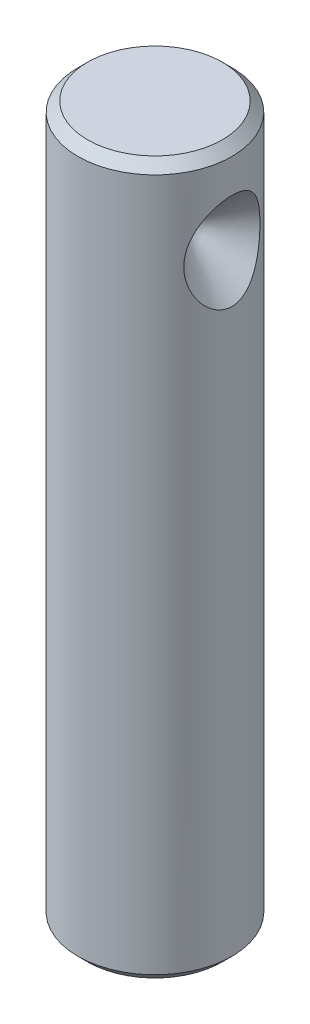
ISO-10303-21;
HEADER;
FILE_DESCRIPTION(('STEP AP214'),'2;1');
FILE_NAME('part.step','',(''),(''),'','','');
FILE_SCHEMA(('AUTOMOTIVE_DESIGN { 1 0 10303 214 1 1 1 1 }'));
ENDSEC;
DATA;
#1=APPLICATION_CONTEXT('core data for automotive mechanical design processes');
#2=APPLICATION_PROTOCOL_DEFINITION('international standard','automotive_design',2000,#1);
#3=PRODUCT_CONTEXT('',#1,'mechanical');
#4=PRODUCT('Part','Part','',(#3));
#5=PRODUCT_RELATED_PRODUCT_CATEGORY('part','',(#4));
#6=PRODUCT_DEFINITION_FORMATION('','',#4);
#7=PRODUCT_DEFINITION_CONTEXT('part definition',#1,'design');
#8=PRODUCT_DEFINITION('design','',#6,#7);
#9=PRODUCT_DEFINITION_SHAPE('','',#8);
#10=(LENGTH_UNIT() NAMED_UNIT(*) SI_UNIT(.MILLI.,.METRE.));
#11=(NAMED_UNIT(*) PLANE_ANGLE_UNIT() SI_UNIT($,.RADIAN.));
#12=(NAMED_UNIT(*) SI_UNIT($,.STERADIAN.) SOLID_ANGLE_UNIT());
#13=UNCERTAINTY_MEASURE_WITH_UNIT(LENGTH_MEASURE(1.E-05),#10,'distance_accuracy_value','');
#14=(GEOMETRIC_REPRESENTATION_CONTEXT(3) GLOBAL_UNCERTAINTY_ASSIGNED_CONTEXT((#13)) GLOBAL_UNIT_ASSIGNED_CONTEXT((#10,
#11,#12)) REPRESENTATION_CONTEXT('',''));
#15=CARTESIAN_POINT('',(0.,0.,0.));
#16=DIRECTION('',(0.,0.,1.));
#17=DIRECTION('',(1.,0.,0.));
#18=AXIS2_PLACEMENT_3D('',#15,#16,#17);
#19=CARTESIAN_POINT('',(0.,37.,0.));
#20=DIRECTION('',(0.,-1.,0.));
#21=DIRECTION('',(0.,0.,-1.));
#22=AXIS2_PLACEMENT_3D('',#19,#20,#21);
#23=CYLINDRICAL_SURFACE('',#22,4.);
#24=CARTESIAN_POINT('',(3.88248247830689,30.0705801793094,-0.962466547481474));
#25=CARTESIAN_POINT('',(3.90125564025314,30.0166133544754,-0.886733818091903));
#26=CARTESIAN_POINT('',(3.91870439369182,29.9679689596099,-0.806848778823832));
#27=CARTESIAN_POINT('',(3.94943555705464,29.8837611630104,-0.639655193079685));
#28=CARTESIAN_POINT('',(3.96272024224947,29.8481906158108,-0.55235073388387));
#29=CARTESIAN_POINT('',(3.98376478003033,29.7923507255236,-0.371432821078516));
#30=CARTESIAN_POINT('',(3.991477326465,29.7722123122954,-0.277772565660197));
#31=CARTESIAN_POINT('',(4.00015429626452,29.7495789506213,-0.088047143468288));
#32=CARTESIAN_POINT('',(4.00112416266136,29.74706977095,0.00801602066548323));
#33=CARTESIAN_POINT('',(3.99653893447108,29.7590083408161,0.185743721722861));
#34=CARTESIAN_POINT('',(3.99185086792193,29.7712026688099,0.267594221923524));
#35=CARTESIAN_POINT('',(3.97784990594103,29.8080193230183,0.428013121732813));
#36=CARTESIAN_POINT('',(3.96853631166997,29.832643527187,0.506581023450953));
#37=CARTESIAN_POINT('',(3.94586197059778,29.8935727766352,0.66059667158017));
#38=CARTESIAN_POINT('',(3.93240926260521,29.9301445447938,0.735923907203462));
#39=CARTESIAN_POINT('',(3.90261115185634,30.0129960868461,0.880385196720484));
#40=CARTESIAN_POINT('',(3.88626383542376,30.0592822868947,0.949515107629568));
#41=CARTESIAN_POINT('',(3.84298305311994,30.1854240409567,1.11444521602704));
#42=CARTESIAN_POINT('',(3.81488034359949,30.270410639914,1.20602742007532));
#43=CARTESIAN_POINT('',(3.75774709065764,30.4541942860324,1.37376207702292));
#44=CARTESIAN_POINT('',(3.72871490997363,30.5530168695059,1.44988534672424));
#45=CARTESIAN_POINT('',(3.67200298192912,30.7631260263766,1.58810352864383));
#46=CARTESIAN_POINT('',(3.64435853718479,30.8746106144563,1.64991046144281));
#47=CARTESIAN_POINT('',(3.59359054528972,31.1058419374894,1.75774167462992));
#48=CARTESIAN_POINT('',(3.57046590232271,31.2255866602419,1.80376978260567));
#49=CARTESIAN_POINT('',(3.52731052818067,31.493778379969,1.88698124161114));
#50=CARTESIAN_POINT('',(3.50863355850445,31.6434504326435,1.92097533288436));
#51=CARTESIAN_POINT('',(3.48349335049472,31.9472003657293,1.96620375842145));
#52=CARTESIAN_POINT('',(3.47702986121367,32.1012781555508,1.97743856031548));
#53=CARTESIAN_POINT('',(3.47733098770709,32.4089559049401,1.97690907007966));
#54=CARTESIAN_POINT('',(3.48405885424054,32.562556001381,1.96520867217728));
#55=CARTESIAN_POINT('',(3.50962061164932,32.8653600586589,1.91917641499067));
#56=CARTESIAN_POINT('',(3.5284620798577,33.0145612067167,1.88483039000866));
#57=CARTESIAN_POINT('',(3.57549079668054,33.3043878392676,1.79400822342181));
#58=CARTESIAN_POINT('',(3.60367294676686,33.4450179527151,1.7375441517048));
#59=CARTESIAN_POINT('',(3.66566251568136,33.7140163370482,1.6026297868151));
#60=CARTESIAN_POINT('',(3.69946752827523,33.8423898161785,1.52418888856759));
#61=CARTESIAN_POINT('',(3.7607376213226,34.055941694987,1.36471837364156));
#62=CARTESIAN_POINT('',(3.78797017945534,34.144423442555,1.28801624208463));
#63=CARTESIAN_POINT('',(3.84071645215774,34.3079935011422,1.12095456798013));
#64=CARTESIAN_POINT('',(3.86623304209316,34.3831045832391,1.03061873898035));
#65=CARTESIAN_POINT('',(3.9076436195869,34.5013239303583,0.858116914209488));
#66=CARTESIAN_POINT('',(3.92442053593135,34.5478380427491,0.778506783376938));
#67=CARTESIAN_POINT('',(3.95376519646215,34.6278978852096,0.612244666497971));
#68=CARTESIAN_POINT('',(3.96633589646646,34.6614527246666,0.525597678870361));
#69=CARTESIAN_POINT('',(3.98599227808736,34.7134911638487,0.346455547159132));
#70=CARTESIAN_POINT('',(3.99303376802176,34.7318533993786,0.253919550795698));
#71=CARTESIAN_POINT('',(4.00053514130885,34.7514060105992,0.0667923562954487));
#72=CARTESIAN_POINT('',(4.00099929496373,34.7526075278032,-0.0277974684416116));
#73=CARTESIAN_POINT('',(3.99566178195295,34.7387063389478,-0.203592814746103));
#74=CARTESIAN_POINT('',(3.99063668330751,34.7256244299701,-0.284992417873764));
#75=CARTESIAN_POINT('',(3.97604362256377,34.6872065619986,-0.444394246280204));
#76=CARTESIAN_POINT('',(3.96647493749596,34.6618686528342,-0.522395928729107));
#77=CARTESIAN_POINT('',(3.94328553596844,34.5994398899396,-0.675809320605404));
#78=CARTESIAN_POINT('',(3.92954529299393,34.5619998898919,-0.751059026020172));
#79=CARTESIAN_POINT('',(3.8992233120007,34.4774520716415,-0.895264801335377));
#80=CARTESIAN_POINT('',(3.88263963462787,34.4303376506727,-0.964216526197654));
#81=CARTESIAN_POINT('',(3.83875449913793,34.3019203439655,-1.12893437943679));
#82=CARTESIAN_POINT('',(3.81030855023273,34.2154540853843,-1.22038427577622));
#83=CARTESIAN_POINT('',(3.75264568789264,34.0287184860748,-1.38762709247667));
#84=CARTESIAN_POINT('',(3.72342743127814,33.9284236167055,-1.46339039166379));
#85=CARTESIAN_POINT('',(3.66654328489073,33.7153818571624,-1.60064852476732));
#86=CARTESIAN_POINT('',(3.63891594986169,33.6024394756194,-1.66185452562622));
#87=CARTESIAN_POINT('',(3.58841979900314,33.3683396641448,-1.76825013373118));
#88=CARTESIAN_POINT('',(3.56554972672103,33.2471844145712,-1.81344397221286));
#89=CARTESIAN_POINT('',(3.52335011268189,32.9767765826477,-1.89432699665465));
#90=CARTESIAN_POINT('',(3.50537521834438,32.8263611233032,-1.92689283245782));
#91=CARTESIAN_POINT('',(3.48182356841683,32.5214012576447,-1.96913759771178));
#92=CARTESIAN_POINT('',(3.47624613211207,32.3668570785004,-1.97881778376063));
#93=CARTESIAN_POINT('',(3.4783613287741,32.0590758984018,-1.97509611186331));
#94=CARTESIAN_POINT('',(3.48597384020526,31.9058366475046,-1.96183361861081));
#95=CARTESIAN_POINT('',(3.5131357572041,31.6040053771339,-1.91275859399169));
#96=CARTESIAN_POINT('',(3.53269465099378,31.4554171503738,-1.87692813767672));
#97=CARTESIAN_POINT('',(3.58097250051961,31.1666802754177,-1.78309093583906));
#98=CARTESIAN_POINT('',(3.60971010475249,31.0265495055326,-1.72503899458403));
#99=CARTESIAN_POINT('',(3.6725298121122,30.7589345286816,-1.58690632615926));
#100=CARTESIAN_POINT('',(3.70660622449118,30.6314370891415,-1.50684898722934));
#101=CARTESIAN_POINT('',(3.76547618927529,30.4287181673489,-1.35126497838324));
#102=CARTESIAN_POINT('',(3.79005817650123,30.3491380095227,-1.28130751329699));
#103=CARTESIAN_POINT('',(3.83783022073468,30.2009211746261,-1.13018966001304));
#104=CARTESIAN_POINT('',(3.86102172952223,30.1322729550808,-1.04904125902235));
#105=CARTESIAN_POINT('',(3.88248247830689,30.0705801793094,-0.962466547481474));
#106=B_SPLINE_CURVE_WITH_KNOTS('',3,(#24,#25,#26,#27,#28,#29,#30,#31,#32,#33,#34,#35,#36,#37,
#38,#39,#40,#41,#42,#43,#44,#45,#46,#47,#48,#49,#50,#51,#52,#53,#54,#55,#56,#57,#58,#59,#60,#61,
#62,#63,#64,#65,#66,#67,#68,#69,#70,#71,#72,#73,#74,#75,#76,#77,#78,#79,#80,#81,#82,#83,#84,#85,
#86,#87,#88,#89,#90,#91,#92,#93,#94,#95,#96,#97,#98,#99,#100,#101,#102,#103,#104,#105),
.UNSPECIFIED.,.T.,.F.,(4,2,2,2,2,2,2,2,2,2,2,2,2,2,2,2,2,2,2,2,2,2,2,2,2,2,2,2,2,2,2,2,2,2,2,2,
2,2,2,2,4),(0.,0.284327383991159,0.568499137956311,0.85505596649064,1.14138144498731,
1.38887768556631,1.63641133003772,1.88989913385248,2.14355515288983,2.52563967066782,
2.90843891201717,3.29837448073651,3.6882153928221,4.14983989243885,4.61145490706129,
5.0717857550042,5.5324048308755,5.99277289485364,6.45294445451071,6.81235772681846,
7.17115291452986,7.45122971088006,7.73110927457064,8.01320360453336,8.29511477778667,
8.54175987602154,8.78844423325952,9.04299810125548,9.2977262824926,9.68270016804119,
10.0683945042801,10.4612001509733,10.8539019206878,11.3164984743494,11.7790696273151,
12.2388407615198,12.6989775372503,13.160055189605,13.6206446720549,13.9460225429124,
14.2710545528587),.UNSPECIFIED.);
#107=CARTESIAN_POINT('',(3.88248247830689,30.0705801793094,-0.962466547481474));
#108=VERTEX_POINT('',#107);
#109=EDGE_CURVE('E46',#108,#108,#106,.T.);
#110=ORIENTED_EDGE('',*,*,#109,.T.);
#111=EDGE_LOOP('',(#110));
#112=FACE_BOUND('',#111,.T.);
#113=CARTESIAN_POINT('',(0.,0.5,0.));
#114=DIRECTION('',(0.,1.,0.));
#115=DIRECTION('',(0.,0.,1.));
#116=AXIS2_PLACEMENT_3D('',#113,#114,#115);
#117=CIRCLE('',#116,4.);
#118=CARTESIAN_POINT('',(0.,0.5,4.));
#119=VERTEX_POINT('',#118);
#120=EDGE_CURVE('E65',#119,#119,#117,.T.);
#121=ORIENTED_EDGE('',*,*,#120,.T.);
#122=EDGE_LOOP('',(#121));
#123=FACE_BOUND('',#122,.T.);
#124=CARTESIAN_POINT('',(0.,36.5,0.));
#125=DIRECTION('',(0.,1.,0.));
#126=DIRECTION('',(0.,0.,1.));
#127=AXIS2_PLACEMENT_3D('',#124,#125,#126);
#128=CIRCLE('',#127,4.);
#129=CARTESIAN_POINT('',(0.,36.5,4.));
#130=VERTEX_POINT('',#129);
#131=EDGE_CURVE('E63',#130,#130,#128,.F.);
#132=ORIENTED_EDGE('',*,*,#131,.T.);
#133=EDGE_LOOP('',(#132));
#134=FACE_BOUND('',#133,.T.);
#135=ADVANCED_FACE('F42',(#112,#123,#134),#23,.T.);
#136=CARTESIAN_POINT('',(0.,37.,0.));
#137=DIRECTION('',(0.,1.,0.));
#138=DIRECTION('',(0.,0.,1.));
#139=AXIS2_PLACEMENT_3D('',#136,#137,#138);
#140=PLANE('',#139);
#141=CARTESIAN_POINT('',(0.,37.,0.));
#142=DIRECTION('',(0.,1.,0.));
#143=DIRECTION('',(0.,0.,1.));
#144=AXIS2_PLACEMENT_3D('',#141,#142,#143);
#145=CIRCLE('',#144,3.5);
#146=CARTESIAN_POINT('',(0.,37.,3.5));
#147=VERTEX_POINT('',#146);
#148=EDGE_CURVE('E13',#147,#147,#145,.T.);
#149=ORIENTED_EDGE('',*,*,#148,.T.);
#150=EDGE_LOOP('',(#149));
#151=FACE_BOUND('',#150,.T.);
#152=ADVANCED_FACE('F83',(#151),#140,.T.);
#153=CARTESIAN_POINT('',(0.,0.,0.));
#154=DIRECTION('',(0.,1.,0.));
#155=DIRECTION('',(0.,0.,1.));
#156=AXIS2_PLACEMENT_3D('',#153,#154,#155);
#157=PLANE('',#156);
#158=CARTESIAN_POINT('',(0.,0.,0.));
#159=DIRECTION('',(0.,1.,0.));
#160=DIRECTION('',(0.,0.,1.));
#161=AXIS2_PLACEMENT_3D('',#158,#159,#160);
#162=CIRCLE('',#161,3.5);
#163=CARTESIAN_POINT('',(0.,0.,3.5));
#164=VERTEX_POINT('',#163);
#165=EDGE_CURVE('E54',#164,#164,#162,.F.);
#166=ORIENTED_EDGE('',*,*,#165,.T.);
#167=EDGE_LOOP('',(#166));
#168=FACE_BOUND('',#167,.T.);
#169=ADVANCED_FACE('F75',(#168),#157,.F.);
#170=CARTESIAN_POINT('',(0.,0.5,0.));
#171=DIRECTION('',(0.,1.,0.));
#172=DIRECTION('',(0.,0.,1.));
#173=AXIS2_PLACEMENT_3D('',#170,#171,#172);
#174=CONICAL_SURFACE('',#173,4.,0.785398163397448);
#175=ORIENTED_EDGE('',*,*,#165,.F.);
#176=EDGE_LOOP('',(#175));
#177=FACE_BOUND('',#176,.T.);
#178=ORIENTED_EDGE('',*,*,#120,.F.);
#179=EDGE_LOOP('',(#178));
#180=FACE_BOUND('',#179,.T.);
#181=ADVANCED_FACE('F77',(#177,#180),#174,.T.);
#182=CARTESIAN_POINT('',(0.,37.,0.));
#183=DIRECTION('',(0.,-1.,0.));
#184=DIRECTION('',(0.,0.,-1.));
#185=AXIS2_PLACEMENT_3D('',#182,#183,#184);
#186=CONICAL_SURFACE('',#185,3.5,0.785398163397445);
#187=ORIENTED_EDGE('',*,*,#131,.F.);
#188=EDGE_LOOP('',(#187));
#189=FACE_BOUND('',#188,.T.);
#190=ORIENTED_EDGE('',*,*,#148,.F.);
#191=EDGE_LOOP('',(#190));
#192=FACE_BOUND('',#191,.T.);
#193=ADVANCED_FACE('F44',(#189,#192),#186,.T.);
#194=CARTESIAN_POINT('',(5.30216698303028,32.25,0.));
#195=DIRECTION('',(1.,0.,0.));
#196=DIRECTION('',(0.,0.,-1.));
#197=AXIS2_PLACEMENT_3D('',#194,#195,#196);
#198=CONICAL_SURFACE('',#197,3.80216698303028,0.785398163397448);
#199=CARTESIAN_POINT('',(1.5,32.25,0.));
#200=VERTEX_POINT('',#199);
#201=VERTEX_LOOP('',#200);
#202=FACE_BOUND('',#201,.T.);
#203=ORIENTED_EDGE('',*,*,#109,.F.);
#204=EDGE_LOOP('',(#203));
#205=FACE_BOUND('',#204,.T.);
#206=ADVANCED_FACE('F57',(#202,#205),#198,.F.);
#207=CLOSED_SHELL('',(#135,#152,#169,#181,#193,#206));
#208=MANIFOLD_SOLID_BREP('B2',#207);
#209=ADVANCED_BREP_SHAPE_REPRESENTATION('',(#18,#208),#14);
#210=SHAPE_DEFINITION_REPRESENTATION(#9,#209);
ENDSEC;
END-ISO-10303-21;
